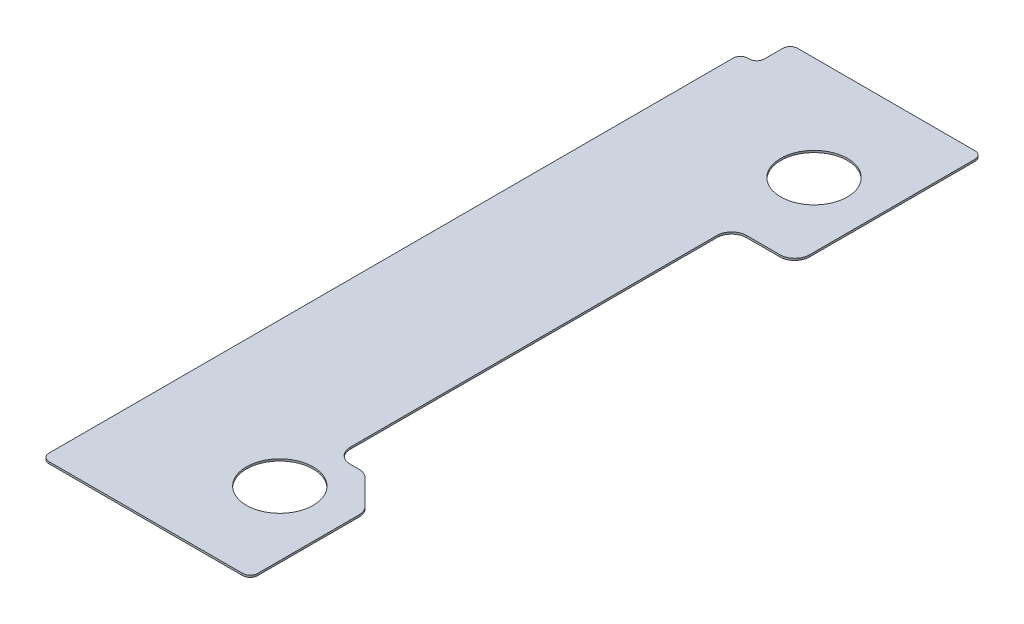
ISO-10303-21;
HEADER;
FILE_DESCRIPTION(('STEP AP214'),'2;1');
FILE_NAME('part.step','',(''),(''),'','','');
FILE_SCHEMA(('AUTOMOTIVE_DESIGN { 1 0 10303 214 1 1 1 1 }'));
ENDSEC;
DATA;
#1=APPLICATION_CONTEXT('core data for automotive mechanical design processes');
#2=APPLICATION_PROTOCOL_DEFINITION('international standard','automotive_design',2000,#1);
#3=PRODUCT_CONTEXT('',#1,'mechanical');
#4=PRODUCT('Part','Part','',(#3));
#5=PRODUCT_RELATED_PRODUCT_CATEGORY('part','',(#4));
#6=PRODUCT_DEFINITION_FORMATION('','',#4);
#7=PRODUCT_DEFINITION_CONTEXT('part definition',#1,'design');
#8=PRODUCT_DEFINITION('design','',#6,#7);
#9=PRODUCT_DEFINITION_SHAPE('','',#8);
#10=(LENGTH_UNIT() NAMED_UNIT(*) SI_UNIT(.MILLI.,.METRE.));
#11=(NAMED_UNIT(*) PLANE_ANGLE_UNIT() SI_UNIT($,.RADIAN.));
#12=(NAMED_UNIT(*) SI_UNIT($,.STERADIAN.) SOLID_ANGLE_UNIT());
#13=UNCERTAINTY_MEASURE_WITH_UNIT(LENGTH_MEASURE(1.E-05),#10,'distance_accuracy_value','');
#14=(GEOMETRIC_REPRESENTATION_CONTEXT(3) GLOBAL_UNCERTAINTY_ASSIGNED_CONTEXT((#13)) GLOBAL_UNIT_ASSIGNED_CONTEXT((#10,
#11,#12)) REPRESENTATION_CONTEXT('',''));
#15=CARTESIAN_POINT('',(0.,0.,0.));
#16=DIRECTION('',(0.,0.,1.));
#17=DIRECTION('',(1.,0.,0.));
#18=AXIS2_PLACEMENT_3D('',#15,#16,#17);
#19=CARTESIAN_POINT('',(8.577632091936,0.2829329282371,1.840361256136));
#20=DIRECTION('',(0.,1.,0.));
#21=DIRECTION('',(-1.75387137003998E-13,0.,-1.));
#22=AXIS2_PLACEMENT_3D('',#19,#20,#21);
#23=PLANE('',#22);
#24=CARTESIAN_POINT('',(3.946632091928,0.282932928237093,-41.49472218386));
#25=DIRECTION('',(0.,-1.,0.));
#26=DIRECTION('',(0.,0.,-1.));
#27=AXIS2_PLACEMENT_3D('',#24,#25,#26);
#28=CIRCLE('',#27,2.25000000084);
#29=CARTESIAN_POINT('',(3.946632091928,0.282932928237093,-43.7447221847));
#30=VERTEX_POINT('',#29);
#31=EDGE_CURVE('E273',#30,#30,#28,.F.);
#32=ORIENTED_EDGE('',*,*,#31,.F.);
#33=EDGE_LOOP('',(#32));
#34=FACE_BOUND('',#33,.T.);
#35=CARTESIAN_POINT('',(3.946632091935,0.282932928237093,-5.494722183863));
#36=DIRECTION('',(0.,-1.,0.));
#37=DIRECTION('',(0.,0.,-1.));
#38=AXIS2_PLACEMENT_3D('',#35,#36,#37);
#39=CIRCLE('',#38,2.250000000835);
#40=CARTESIAN_POINT('',(3.946632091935,0.282932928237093,-7.744722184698));
#41=VERTEX_POINT('',#40);
#42=EDGE_CURVE('E190',#41,#41,#39,.F.);
#43=ORIENTED_EDGE('',*,*,#42,.F.);
#44=EDGE_LOOP('',(#43));
#45=FACE_BOUND('',#44,.T.);
#46=CARTESIAN_POINT('',(5.046632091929,0.282932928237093,-34.84472218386));
#47=DIRECTION('',(0.,-1.,0.));
#48=DIRECTION('',(0.,0.,-1.));
#49=AXIS2_PLACEMENT_3D('',#46,#47,#48);
#50=CIRCLE('',#49,1.);
#51=CARTESIAN_POINT('',(5.04663209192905,0.282932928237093,-35.84472218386));
#52=VERTEX_POINT('',#51);
#53=CARTESIAN_POINT('',(4.0466320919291,0.282932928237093,-34.8447221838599));
#54=VERTEX_POINT('',#53);
#55=EDGE_CURVE('E175',#52,#54,#50,.F.);
#56=ORIENTED_EDGE('',*,*,#55,.F.);
#57=DIRECTION('',(-1.,0.,0.));
#58=VECTOR('',#57,1.);
#59=CARTESIAN_POINT('',(6.171632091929,0.282932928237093,-35.84472218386));
#60=LINE('',#59,#58);
#61=CARTESIAN_POINT('',(7.29663209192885,0.282932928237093,-35.84472218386));
#62=VERTEX_POINT('',#61);
#63=EDGE_CURVE('E173',#62,#52,#60,.T.);
#64=ORIENTED_EDGE('',*,*,#63,.F.);
#65=CARTESIAN_POINT('',(7.296632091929,0.282932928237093,-36.84472218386));
#66=DIRECTION('',(0.,1.,0.));
#67=DIRECTION('',(0.,0.,1.));
#68=AXIS2_PLACEMENT_3D('',#65,#66,#67);
#69=CIRCLE('',#68,0.999999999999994);
#70=CARTESIAN_POINT('',(8.29663209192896,0.282932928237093,-36.8447221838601));
#71=VERTEX_POINT('',#70);
#72=EDGE_CURVE('E19',#62,#71,#69,.T.);
#73=ORIENTED_EDGE('',*,*,#72,.T.);
#74=DIRECTION('',(1.72613245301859E-13,0.,1.));
#75=VECTOR('',#74,1.);
#76=CARTESIAN_POINT('',(8.296632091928,0.282932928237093,-42.41558046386));
#77=LINE('',#76,#75);
#78=CARTESIAN_POINT('',(8.29663209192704,0.282932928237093,-47.98643874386));
#79=VERTEX_POINT('',#78);
#80=EDGE_CURVE('E188',#79,#71,#77,.T.);
#81=ORIENTED_EDGE('',*,*,#80,.F.);
#82=CARTESIAN_POINT('',(7.796632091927,0.282932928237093,-47.98643874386));
#83=DIRECTION('',(0.,1.,0.));
#84=DIRECTION('',(0.,0.,1.));
#85=AXIS2_PLACEMENT_3D('',#82,#83,#84);
#86=CIRCLE('',#85,0.500000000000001);
#87=CARTESIAN_POINT('',(7.79663209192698,0.282932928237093,-48.48643874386));
#88=VERTEX_POINT('',#87);
#89=EDGE_CURVE('E278',#79,#88,#86,.T.);
#90=ORIENTED_EDGE('',*,*,#89,.T.);
#91=DIRECTION('',(1.,0.,0.));
#92=VECTOR('',#91,1.);
#93=CARTESIAN_POINT('',(1.821632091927,0.282932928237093,-48.48643874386));
#94=LINE('',#93,#92);
#95=CARTESIAN_POINT('',(-4.153367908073,0.282932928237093,-48.48643874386));
#96=VERTEX_POINT('',#95);
#97=EDGE_CURVE('E191',#96,#88,#94,.T.);
#98=ORIENTED_EDGE('',*,*,#97,.F.);
#99=CARTESIAN_POINT('',(-4.153367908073,0.282932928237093,-47.98643874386));
#100=DIRECTION('',(0.,1.,0.));
#101=DIRECTION('',(0.,0.,1.));
#102=AXIS2_PLACEMENT_3D('',#99,#100,#101);
#103=CIRCLE('',#102,0.499999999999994);
#104=CARTESIAN_POINT('',(-4.65336790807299,0.282932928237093,-47.98643874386));
#105=VERTEX_POINT('',#104);
#106=EDGE_CURVE('E281',#96,#105,#103,.T.);
#107=ORIENTED_EDGE('',*,*,#106,.T.);
#108=DIRECTION('',(0.,0.,-1.));
#109=VECTOR('',#108,1.);
#110=CARTESIAN_POINT('',(-4.653367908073,0.282932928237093,-47.361438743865));
#111=LINE('',#110,#109);
#112=CARTESIAN_POINT('',(-4.653367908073,0.282932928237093,-46.7364387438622));
#113=VERTEX_POINT('',#112);
#114=EDGE_CURVE('E195',#113,#105,#111,.T.);
#115=ORIENTED_EDGE('',*,*,#114,.F.);
#116=CARTESIAN_POINT('',(-5.153367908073,0.282932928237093,-46.73643874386));
#117=DIRECTION('',(0.,-1.,0.));
#118=DIRECTION('',(0.,0.,-1.));
#119=AXIS2_PLACEMENT_3D('',#116,#117,#118);
#120=CIRCLE('',#119,0.5);
#121=CARTESIAN_POINT('',(-5.15336790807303,0.282932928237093,-46.23643874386));
#122=VERTEX_POINT('',#121);
#123=EDGE_CURVE('E284',#122,#113,#120,.F.);
#124=ORIENTED_EDGE('',*,*,#123,.F.);
#125=DIRECTION('',(1.,0.,0.));
#126=VECTOR('',#125,1.);
#127=CARTESIAN_POINT('',(-5.203367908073,0.282932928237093,-46.23643874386));
#128=LINE('',#127,#126);
#129=CARTESIAN_POINT('',(-5.25336790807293,0.282932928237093,-46.23643874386));
#130=VERTEX_POINT('',#129);
#131=EDGE_CURVE('E199',#130,#122,#128,.T.);
#132=ORIENTED_EDGE('',*,*,#131,.F.);
#133=CARTESIAN_POINT('',(-5.253367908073,0.282932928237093,-45.73643874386));
#134=DIRECTION('',(0.,1.,0.));
#135=DIRECTION('',(0.,0.,1.));
#136=AXIS2_PLACEMENT_3D('',#133,#134,#135);
#137=CIRCLE('',#136,0.499999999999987);
#138=CARTESIAN_POINT('',(-5.75336790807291,0.282932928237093,-45.7364387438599));
#139=VERTEX_POINT('',#138);
#140=EDGE_CURVE('E286',#130,#139,#137,.T.);
#141=ORIENTED_EDGE('',*,*,#140,.T.);
#142=DIRECTION('',(-1.87754422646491E-13,0.,-1.));
#143=VECTOR('',#142,1.);
#144=CARTESIAN_POINT('',(-5.7533679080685,0.282932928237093,-22.6914387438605));
#145=LINE('',#144,#143);
#146=CARTESIAN_POINT('',(-5.75336790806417,0.282932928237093,0.353561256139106));
#147=VERTEX_POINT('',#146);
#148=EDGE_CURVE('E203',#147,#139,#145,.T.);
#149=ORIENTED_EDGE('',*,*,#148,.F.);
#150=CARTESIAN_POINT('',(-5.253367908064,0.282932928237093,0.3535612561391));
#151=DIRECTION('',(0.,1.,0.));
#152=DIRECTION('',(0.,0.,1.));
#153=AXIS2_PLACEMENT_3D('',#150,#151,#152);
#154=CIRCLE('',#153,0.5);
#155=CARTESIAN_POINT('',(-5.25336790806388,0.282932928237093,0.853561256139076));
#156=VERTEX_POINT('',#155);
#157=EDGE_CURVE('E289',#147,#156,#154,.T.);
#158=ORIENTED_EDGE('',*,*,#157,.T.);
#159=DIRECTION('',(-1.,0.,1.8419134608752E-13));
#160=VECTOR('',#159,1.);
#161=CARTESIAN_POINT('',(1.271632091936,0.282932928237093,0.85356125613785));
#162=LINE('',#161,#160);
#163=CARTESIAN_POINT('',(7.79663209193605,0.282932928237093,0.853561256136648));
#164=VERTEX_POINT('',#163);
#165=EDGE_CURVE('E207',#164,#156,#162,.T.);
#166=ORIENTED_EDGE('',*,*,#165,.F.);
#167=CARTESIAN_POINT('',(7.796632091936,0.282932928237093,0.3535612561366));
#168=DIRECTION('',(0.,1.,0.));
#169=DIRECTION('',(0.,0.,1.));
#170=AXIS2_PLACEMENT_3D('',#167,#168,#169);
#171=CIRCLE('',#170,0.5);
#172=CARTESIAN_POINT('',(8.29663209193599,0.282932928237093,0.353561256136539));
#173=VERTEX_POINT('',#172);
#174=EDGE_CURVE('E292',#164,#173,#171,.T.);
#175=ORIENTED_EDGE('',*,*,#174,.T.);
#176=DIRECTION('',(1.40585323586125E-13,0.,1.));
#177=VECTOR('',#176,1.);
#178=CARTESIAN_POINT('',(8.2966320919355,0.282932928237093,-3.06347368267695));
#179=LINE('',#178,#177);
#180=CARTESIAN_POINT('',(8.29663209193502,0.282932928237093,-6.48050862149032));
#181=VERTEX_POINT('',#180);
#182=EDGE_CURVE('E211',#181,#173,#179,.T.);
#183=ORIENTED_EDGE('',*,*,#182,.F.);
#184=CARTESIAN_POINT('',(7.296632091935,0.282932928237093,-6.48050862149));
#185=DIRECTION('',(0.,1.,0.));
#186=DIRECTION('',(0.,0.,1.));
#187=AXIS2_PLACEMENT_3D('',#184,#185,#186);
#188=CIRCLE('',#187,1.);
#189=CARTESIAN_POINT('',(8.00373887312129,0.282932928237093,-7.18761540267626));
#190=VERTEX_POINT('',#189);
#191=EDGE_CURVE('E295',#181,#190,#188,.T.);
#192=ORIENTED_EDGE('',*,*,#191,.T.);
#193=DIRECTION('',(0.707106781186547,0.,0.707106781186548));
#194=VECTOR('',#193,1.);
#195=CARTESIAN_POINT('',(7.171632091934,0.282932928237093,-8.019722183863));
#196=LINE('',#195,#194);
#197=CARTESIAN_POINT('',(6.33952531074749,0.282932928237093,-8.85182896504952));
#198=VERTEX_POINT('',#197);
#199=EDGE_CURVE('E215',#198,#190,#196,.T.);
#200=ORIENTED_EDGE('',*,*,#199,.F.);
#201=CARTESIAN_POINT('',(5.632418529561,0.282932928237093,-8.144722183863));
#202=DIRECTION('',(0.,1.,0.));
#203=DIRECTION('',(0.,0.,1.));
#204=AXIS2_PLACEMENT_3D('',#201,#202,#203);
#205=CIRCLE('',#204,1.00000000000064);
#206=CARTESIAN_POINT('',(5.63241852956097,0.282932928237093,-9.14472218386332));
#207=VERTEX_POINT('',#206);
#208=EDGE_CURVE('E298',#198,#207,#205,.T.);
#209=ORIENTED_EDGE('',*,*,#208,.T.);
#210=DIRECTION('',(1.,0.,0.));
#211=VECTOR('',#210,1.);
#212=CARTESIAN_POINT('',(5.3395253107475,0.282932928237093,-9.144722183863));
#213=LINE('',#212,#211);
#214=CARTESIAN_POINT('',(5.04663209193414,0.282932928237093,-9.144722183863));
#215=VERTEX_POINT('',#214);
#216=EDGE_CURVE('E219',#215,#207,#213,.T.);
#217=ORIENTED_EDGE('',*,*,#216,.F.);
#218=CARTESIAN_POINT('',(5.046632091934,0.282932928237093,-10.14472218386));
#219=DIRECTION('',(0.,-1.,0.));
#220=DIRECTION('',(0.,0.,-1.));
#221=AXIS2_PLACEMENT_3D('',#218,#219,#220);
#222=CIRCLE('',#221,0.999999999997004);
#223=CARTESIAN_POINT('',(4.04663209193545,0.282932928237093,-10.14472218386));
#224=VERTEX_POINT('',#223);
#225=EDGE_CURVE('E301',#224,#215,#222,.F.);
#226=ORIENTED_EDGE('',*,*,#225,.F.);
#227=DIRECTION('',(1.94656665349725E-13,0.,1.));
#228=VECTOR('',#227,1.);
#229=CARTESIAN_POINT('',(4.0466320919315,0.282932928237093,-22.4947221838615));
#230=LINE('',#229,#228);
#231=EDGE_CURVE('E223',#54,#224,#230,.T.);
#232=ORIENTED_EDGE('',*,*,#231,.F.);
#233=EDGE_LOOP('',(#56,#64,#73,#81,#90,#98,#107,#115,#124,#132,#141,#149,#158,#166,#175,#183,
#192,#200,#209,#217,#226,#232));
#234=FACE_BOUND('',#233,.T.);
#235=ADVANCED_FACE('F15',(#34,#45,#234),#23,.T.);
#236=CARTESIAN_POINT('',(7.296632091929,0.152932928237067,-36.84472218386));
#237=DIRECTION('',(0.,1.,0.));
#238=DIRECTION('',(0.,0.,1.));
#239=AXIS2_PLACEMENT_3D('',#236,#237,#238);
#240=CYLINDRICAL_SURFACE('',#239,0.999999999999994);
#241=DIRECTION('',(0.,1.,0.));
#242=VECTOR('',#241,1.);
#243=CARTESIAN_POINT('',(7.29663209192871,0.21793292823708,-35.84472218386));
#244=LINE('',#243,#242);
#245=CARTESIAN_POINT('',(7.29663209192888,0.152932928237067,-35.8447221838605));
#246=VERTEX_POINT('',#245);
#247=EDGE_CURVE('E165',#246,#62,#244,.T.);
#248=ORIENTED_EDGE('',*,*,#247,.F.);
#249=CARTESIAN_POINT('',(7.296632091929,0.152932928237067,-36.84472218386));
#250=DIRECTION('',(0.,1.,0.));
#251=DIRECTION('',(0.,0.,1.));
#252=AXIS2_PLACEMENT_3D('',#249,#250,#251);
#253=CIRCLE('',#252,0.999999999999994);
#254=CARTESIAN_POINT('',(8.29663209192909,0.152932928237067,-36.8447221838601));
#255=VERTEX_POINT('',#254);
#256=EDGE_CURVE('E271',#255,#246,#253,.F.);
#257=ORIENTED_EDGE('',*,*,#256,.F.);
#258=DIRECTION('',(0.,-1.,0.));
#259=VECTOR('',#258,1.);
#260=CARTESIAN_POINT('',(8.29663209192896,0.21793292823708,-36.84472218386));
#261=LINE('',#260,#259);
#262=EDGE_CURVE('E168',#71,#255,#261,.T.);
#263=ORIENTED_EDGE('',*,*,#262,.F.);
#264=ORIENTED_EDGE('',*,*,#72,.F.);
#265=EDGE_LOOP('',(#248,#257,#263,#264));
#266=FACE_BOUND('',#265,.T.);
#267=ADVANCED_FACE('F163',(#266),#240,.T.);
#268=CARTESIAN_POINT('',(7.358194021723,0.3444948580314,-35.84472218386));
#269=DIRECTION('',(0.,0.,1.));
#270=DIRECTION('',(-1.,0.,0.));
#271=AXIS2_PLACEMENT_3D('',#268,#269,#270);
#272=PLANE('',#271);
#273=DIRECTION('',(0.,1.,0.));
#274=VECTOR('',#273,1.);
#275=CARTESIAN_POINT('',(5.04663209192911,0.21793292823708,-35.84472218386));
#276=LINE('',#275,#274);
#277=CARTESIAN_POINT('',(5.04663209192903,0.152932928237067,-35.8447221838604));
#278=VERTEX_POINT('',#277);
#279=EDGE_CURVE('E178',#278,#52,#276,.T.);
#280=ORIENTED_EDGE('',*,*,#279,.F.);
#281=DIRECTION('',(-1.,0.,0.));
#282=VECTOR('',#281,1.);
#283=CARTESIAN_POINT('',(1.27163209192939,0.1529329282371,-35.8447221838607));
#284=LINE('',#283,#282);
#285=EDGE_CURVE('E182',#246,#278,#284,.T.);
#286=ORIENTED_EDGE('',*,*,#285,.F.);
#287=ORIENTED_EDGE('',*,*,#247,.T.);
#288=ORIENTED_EDGE('',*,*,#63,.T.);
#289=EDGE_LOOP('',(#280,#286,#287,#288));
#290=FACE_BOUND('',#289,.T.);
#291=ADVANCED_FACE('F180',(#290),#272,.T.);
#292=CARTESIAN_POINT('',(5.046632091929,0.282932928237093,-34.84472218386));
#293=DIRECTION('',(0.,-1.,0.));
#294=DIRECTION('',(0.,0.,-1.));
#295=AXIS2_PLACEMENT_3D('',#292,#293,#294);
#296=CYLINDRICAL_SURFACE('',#295,1.);
#297=ORIENTED_EDGE('',*,*,#279,.T.);
#298=ORIENTED_EDGE('',*,*,#55,.T.);
#299=DIRECTION('',(0.,1.,0.));
#300=VECTOR('',#299,1.);
#301=CARTESIAN_POINT('',(4.0466320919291,0.21793292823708,-34.8447221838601));
#302=LINE('',#301,#300);
#303=CARTESIAN_POINT('',(4.04663209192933,0.152932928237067,-34.8447221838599));
#304=VERTEX_POINT('',#303);
#305=EDGE_CURVE('E225',#304,#54,#302,.T.);
#306=ORIENTED_EDGE('',*,*,#305,.F.);
#307=CARTESIAN_POINT('',(5.046632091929,0.152932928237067,-34.84472218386));
#308=DIRECTION('',(0.,-1.,0.));
#309=DIRECTION('',(0.,0.,-1.));
#310=AXIS2_PLACEMENT_3D('',#307,#308,#309);
#311=CIRCLE('',#310,1.);
#312=EDGE_CURVE('E268',#278,#304,#311,.F.);
#313=ORIENTED_EDGE('',*,*,#312,.F.);
#314=EDGE_LOOP('',(#297,#298,#306,#313));
#315=FACE_BOUND('',#314,.T.);
#316=ADVANCED_FACE('F305',(#315),#296,.F.);
#317=CARTESIAN_POINT('',(4.046632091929,0.3444948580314,-35.33872218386));
#318=DIRECTION('',(1.,0.,-1.94656665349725E-13));
#319=DIRECTION('',(1.94656665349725E-13,0.,1.));
#320=AXIS2_PLACEMENT_3D('',#317,#318,#319);
#321=PLANE('',#320);
#322=DIRECTION('',(0.,1.,0.));
#323=VECTOR('',#322,1.);
#324=CARTESIAN_POINT('',(4.046632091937,0.21793292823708,-10.1447221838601));
#325=LINE('',#324,#323);
#326=CARTESIAN_POINT('',(4.04663209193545,0.152932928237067,-10.14472218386));
#327=VERTEX_POINT('',#326);
#328=EDGE_CURVE('E224',#327,#224,#325,.T.);
#329=ORIENTED_EDGE('',*,*,#328,.F.);
#330=DIRECTION('',(1.75387137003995E-13,0.,1.));
#331=VECTOR('',#330,1.);
#332=CARTESIAN_POINT('',(4.0466320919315,0.1529329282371,-23.8164387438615));
#333=LINE('',#332,#331);
#334=EDGE_CURVE('E267',#304,#327,#333,.T.);
#335=ORIENTED_EDGE('',*,*,#334,.F.);
#336=ORIENTED_EDGE('',*,*,#305,.T.);
#337=ORIENTED_EDGE('',*,*,#231,.T.);
#338=EDGE_LOOP('',(#329,#335,#336,#337));
#339=FACE_BOUND('',#338,.T.);
#340=ADVANCED_FACE('F348',(#339),#321,.T.);
#341=CARTESIAN_POINT('',(5.046632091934,0.282932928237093,-10.14472218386));
#342=DIRECTION('',(0.,-1.,0.));
#343=DIRECTION('',(0.,0.,-1.));
#344=AXIS2_PLACEMENT_3D('',#341,#342,#343);
#345=CYLINDRICAL_SURFACE('',#344,0.999999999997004);
#346=ORIENTED_EDGE('',*,*,#328,.T.);
#347=ORIENTED_EDGE('',*,*,#225,.T.);
#348=DIRECTION('',(0.,1.,0.));
#349=VECTOR('',#348,1.);
#350=CARTESIAN_POINT('',(5.04663209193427,0.21793292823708,-9.144722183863));
#351=LINE('',#350,#349);
#352=CARTESIAN_POINT('',(5.04663209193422,0.152932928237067,-9.14472218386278));
#353=VERTEX_POINT('',#352);
#354=EDGE_CURVE('E222',#353,#215,#351,.T.);
#355=ORIENTED_EDGE('',*,*,#354,.F.);
#356=CARTESIAN_POINT('',(5.046632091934,0.152932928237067,-10.14472218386));
#357=DIRECTION('',(0.,-1.,0.));
#358=DIRECTION('',(0.,0.,-1.));
#359=AXIS2_PLACEMENT_3D('',#356,#357,#358);
#360=CIRCLE('',#359,0.999999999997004);
#361=EDGE_CURVE('E264',#327,#353,#360,.F.);
#362=ORIENTED_EDGE('',*,*,#361,.F.);
#363=EDGE_LOOP('',(#346,#347,#355,#362));
#364=FACE_BOUND('',#363,.T.);
#365=ADVANCED_FACE('F344',(#364),#345,.F.);
#366=CARTESIAN_POINT('',(4.98507016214,0.3444948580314,-9.144722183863));
#367=DIRECTION('',(0.,0.,-1.));
#368=DIRECTION('',(1.,0.,0.));
#369=AXIS2_PLACEMENT_3D('',#366,#367,#368);
#370=PLANE('',#369);
#371=ORIENTED_EDGE('',*,*,#354,.T.);
#372=ORIENTED_EDGE('',*,*,#216,.T.);
#373=DIRECTION('',(0.,-1.,0.));
#374=VECTOR('',#373,1.);
#375=CARTESIAN_POINT('',(5.63241852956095,0.21793292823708,-9.14472218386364));
#376=LINE('',#375,#374);
#377=CARTESIAN_POINT('',(5.63241852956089,0.152932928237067,-9.14472218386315));
#378=VERTEX_POINT('',#377);
#379=EDGE_CURVE('E221',#207,#378,#376,.T.);
#380=ORIENTED_EDGE('',*,*,#379,.T.);
#381=DIRECTION('',(1.,0.,-1.61339255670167E-13));
#382=VECTOR('',#381,1.);
#383=CARTESIAN_POINT('',(1.27163209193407,0.1529329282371,-9.14472218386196));
#384=LINE('',#383,#382);
#385=EDGE_CURVE('E263',#353,#378,#384,.T.);
#386=ORIENTED_EDGE('',*,*,#385,.F.);
#387=EDGE_LOOP('',(#371,#372,#380,#386));
#388=FACE_BOUND('',#387,.T.);
#389=ADVANCED_FACE('F353',(#388),#370,.T.);
#390=CARTESIAN_POINT('',(5.632418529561,0.152932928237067,-8.144722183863));
#391=DIRECTION('',(0.,1.,0.));
#392=DIRECTION('',(0.,0.,1.));
#393=AXIS2_PLACEMENT_3D('',#390,#391,#392);
#394=CYLINDRICAL_SURFACE('',#393,1.00000000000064);
#395=DIRECTION('',(0.,1.,0.));
#396=VECTOR('',#395,1.);
#397=CARTESIAN_POINT('',(6.33952531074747,0.21793292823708,-8.85182896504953));
#398=LINE('',#397,#396);
#399=CARTESIAN_POINT('',(6.3395253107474,0.152932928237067,-8.85182896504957));
#400=VERTEX_POINT('',#399);
#401=EDGE_CURVE('E218',#400,#198,#398,.T.);
#402=ORIENTED_EDGE('',*,*,#401,.F.);
#403=CARTESIAN_POINT('',(5.632418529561,0.152932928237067,-8.144722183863));
#404=DIRECTION('',(0.,1.,0.));
#405=DIRECTION('',(0.,0.,1.));
#406=AXIS2_PLACEMENT_3D('',#403,#404,#405);
#407=CIRCLE('',#406,1.00000000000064);
#408=EDGE_CURVE('E260',#378,#400,#407,.F.);
#409=ORIENTED_EDGE('',*,*,#408,.F.);
#410=ORIENTED_EDGE('',*,*,#379,.F.);
#411=ORIENTED_EDGE('',*,*,#208,.F.);
#412=EDGE_LOOP('',(#402,#409,#410,#411));
#413=FACE_BOUND('',#412,.T.);
#414=ADVANCED_FACE('F425',(#413),#394,.T.);
#415=CARTESIAN_POINT('',(6.295994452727,0.3444948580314,-8.89535982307));
#416=DIRECTION('',(0.707106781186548,0.,-0.707106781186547));
#417=DIRECTION('',(0.707106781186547,0.,0.707106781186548));
#418=AXIS2_PLACEMENT_3D('',#415,#416,#417);
#419=PLANE('',#418);
#420=ORIENTED_EDGE('',*,*,#401,.T.);
#421=ORIENTED_EDGE('',*,*,#199,.T.);
#422=DIRECTION('',(0.,-1.,0.));
#423=VECTOR('',#422,1.);
#424=CARTESIAN_POINT('',(8.00373887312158,0.21793292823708,-7.18761540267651));
#425=LINE('',#424,#423);
#426=CARTESIAN_POINT('',(8.00373887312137,0.152932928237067,-7.18761540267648));
#427=VERTEX_POINT('',#426);
#428=EDGE_CURVE('E217',#190,#427,#425,.T.);
#429=ORIENTED_EDGE('',*,*,#428,.T.);
#430=DIRECTION('',(0.707106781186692,0.,0.707106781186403));
#431=VECTOR('',#430,1.);
#432=CARTESIAN_POINT('',(6.33952531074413,0.1529329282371,-8.8518289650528));
#433=LINE('',#432,#431);
#434=EDGE_CURVE('E257',#400,#427,#433,.T.);
#435=ORIENTED_EDGE('',*,*,#434,.F.);
#436=EDGE_LOOP('',(#420,#421,#429,#435));
#437=FACE_BOUND('',#436,.T.);
#438=ADVANCED_FACE('F423',(#437),#419,.T.);
#439=CARTESIAN_POINT('',(7.296632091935,0.152932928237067,-6.48050862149));
#440=DIRECTION('',(0.,1.,0.));
#441=DIRECTION('',(0.,0.,1.));
#442=AXIS2_PLACEMENT_3D('',#439,#440,#441);
#443=CYLINDRICAL_SURFACE('',#442,1.);
#444=DIRECTION('',(0.,1.,0.));
#445=VECTOR('',#444,1.);
#446=CARTESIAN_POINT('',(8.29663209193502,0.21793292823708,-6.4805086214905));
#447=LINE('',#446,#445);
#448=CARTESIAN_POINT('',(8.29663209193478,0.152932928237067,-6.48050862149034));
#449=VERTEX_POINT('',#448);
#450=EDGE_CURVE('E214',#449,#181,#447,.T.);
#451=ORIENTED_EDGE('',*,*,#450,.F.);
#452=CARTESIAN_POINT('',(7.296632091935,0.152932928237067,-6.48050862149));
#453=DIRECTION('',(0.,1.,0.));
#454=DIRECTION('',(0.,0.,1.));
#455=AXIS2_PLACEMENT_3D('',#452,#453,#454);
#456=CIRCLE('',#455,1.);
#457=EDGE_CURVE('E254',#427,#449,#456,.F.);
#458=ORIENTED_EDGE('',*,*,#457,.F.);
#459=ORIENTED_EDGE('',*,*,#428,.F.);
#460=ORIENTED_EDGE('',*,*,#191,.F.);
#461=EDGE_LOOP('',(#451,#458,#459,#460));
#462=FACE_BOUND('',#461,.T.);
#463=ADVANCED_FACE('F420',(#462),#443,.T.);
#464=CARTESIAN_POINT('',(8.296632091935,0.3444948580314,-6.617190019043));
#465=DIRECTION('',(1.,0.,-1.40585323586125E-13));
#466=DIRECTION('',(1.40585323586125E-13,0.,1.));
#467=AXIS2_PLACEMENT_3D('',#464,#465,#466);
#468=PLANE('',#467);
#469=DIRECTION('',(0.,-1.,0.));
#470=VECTOR('',#469,1.);
#471=CARTESIAN_POINT('',(8.296632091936,0.21793292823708,0.353561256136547));
#472=LINE('',#471,#470);
#473=CARTESIAN_POINT('',(8.29663209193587,0.152932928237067,0.35356125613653));
#474=VERTEX_POINT('',#473);
#475=EDGE_CURVE('E213',#173,#474,#472,.T.);
#476=ORIENTED_EDGE('',*,*,#475,.T.);
#477=DIRECTION('',(1.75387137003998E-13,0.,1.));
#478=VECTOR('',#477,1.);
#479=CARTESIAN_POINT('',(8.2966320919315,0.1529329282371,-23.816438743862));
#480=LINE('',#479,#478);
#481=EDGE_CURVE('E253',#449,#474,#480,.T.);
#482=ORIENTED_EDGE('',*,*,#481,.F.);
#483=ORIENTED_EDGE('',*,*,#450,.T.);
#484=ORIENTED_EDGE('',*,*,#182,.T.);
#485=EDGE_LOOP('',(#476,#482,#483,#484));
#486=FACE_BOUND('',#485,.T.);
#487=ADVANCED_FACE('F416',(#486),#468,.T.);
#488=CARTESIAN_POINT('',(7.796632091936,0.152932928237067,0.3535612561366));
#489=DIRECTION('',(0.,1.,0.));
#490=DIRECTION('',(0.,0.,1.));
#491=AXIS2_PLACEMENT_3D('',#488,#489,#490);
#492=CYLINDRICAL_SURFACE('',#491,0.5);
#493=DIRECTION('',(0.,1.,0.));
#494=VECTOR('',#493,1.);
#495=CARTESIAN_POINT('',(7.796632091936,0.21793292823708,0.853561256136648));
#496=LINE('',#495,#494);
#497=CARTESIAN_POINT('',(7.79663209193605,0.152932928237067,0.853561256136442));
#498=VERTEX_POINT('',#497);
#499=EDGE_CURVE('E210',#498,#164,#496,.T.);
#500=ORIENTED_EDGE('',*,*,#499,.F.);
#501=CARTESIAN_POINT('',(7.796632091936,0.152932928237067,0.3535612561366));
#502=DIRECTION('',(0.,1.,0.));
#503=DIRECTION('',(0.,0.,1.));
#504=AXIS2_PLACEMENT_3D('',#501,#502,#503);
#505=CIRCLE('',#504,0.5);
#506=EDGE_CURVE('E250',#474,#498,#505,.F.);
#507=ORIENTED_EDGE('',*,*,#506,.F.);
#508=ORIENTED_EDGE('',*,*,#475,.F.);
#509=ORIENTED_EDGE('',*,*,#174,.F.);
#510=EDGE_LOOP('',(#500,#507,#508,#509));
#511=FACE_BOUND('',#510,.T.);
#512=ADVANCED_FACE('F413',(#511),#492,.T.);
#513=CARTESIAN_POINT('',(8.057632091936,0.3444948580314,0.8535612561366));
#514=DIRECTION('',(1.8419134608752E-13,0.,1.));
#515=DIRECTION('',(-1.,0.,1.8419134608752E-13));
#516=AXIS2_PLACEMENT_3D('',#513,#514,#515);
#517=PLANE('',#516);
#518=ORIENTED_EDGE('',*,*,#499,.T.);
#519=ORIENTED_EDGE('',*,*,#165,.T.);
#520=DIRECTION('',(0.,-1.,0.));
#521=VECTOR('',#520,1.);
#522=CARTESIAN_POINT('',(-5.25336790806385,0.21793292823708,0.8535612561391));
#523=LINE('',#522,#521);
#524=CARTESIAN_POINT('',(-5.25336790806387,0.152932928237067,0.853561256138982));
#525=VERTEX_POINT('',#524);
#526=EDGE_CURVE('E209',#156,#525,#523,.T.);
#527=ORIENTED_EDGE('',*,*,#526,.T.);
#528=DIRECTION('',(-1.,0.,2.01347592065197E-13));
#529=VECTOR('',#528,1.);
#530=CARTESIAN_POINT('',(1.27163209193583,0.1529329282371,0.853561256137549));
#531=LINE('',#530,#529);
#532=EDGE_CURVE('E249',#498,#525,#531,.T.);
#533=ORIENTED_EDGE('',*,*,#532,.F.);
#534=EDGE_LOOP('',(#518,#519,#527,#533));
#535=FACE_BOUND('',#534,.T.);
#536=ADVANCED_FACE('F410',(#535),#517,.T.);
#537=CARTESIAN_POINT('',(-5.253367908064,0.152932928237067,0.3535612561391));
#538=DIRECTION('',(0.,1.,0.));
#539=DIRECTION('',(0.,0.,1.));
#540=AXIS2_PLACEMENT_3D('',#537,#538,#539);
#541=CYLINDRICAL_SURFACE('',#540,0.5);
#542=DIRECTION('',(0.,1.,0.));
#543=VECTOR('',#542,1.);
#544=CARTESIAN_POINT('',(-5.75336790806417,0.21793292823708,0.353561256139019));
#545=LINE('',#544,#543);
#546=CARTESIAN_POINT('',(-5.75336790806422,0.152932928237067,0.353561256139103));
#547=VERTEX_POINT('',#546);
#548=EDGE_CURVE('E206',#547,#147,#545,.T.);
#549=ORIENTED_EDGE('',*,*,#548,.F.);
#550=CARTESIAN_POINT('',(-5.253367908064,0.152932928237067,0.3535612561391));
#551=DIRECTION('',(0.,1.,0.));
#552=DIRECTION('',(0.,0.,1.));
#553=AXIS2_PLACEMENT_3D('',#550,#551,#552);
#554=CIRCLE('',#553,0.5);
#555=EDGE_CURVE('E246',#525,#547,#554,.F.);
#556=ORIENTED_EDGE('',*,*,#555,.F.);
#557=ORIENTED_EDGE('',*,*,#526,.F.);
#558=ORIENTED_EDGE('',*,*,#157,.F.);
#559=EDGE_LOOP('',(#549,#556,#557,#558));
#560=FACE_BOUND('',#559,.T.);
#561=ADVANCED_FACE('F403',(#560),#541,.T.);
#562=CARTESIAN_POINT('',(-5.753367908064,0.3444948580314,1.275361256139));
#563=DIRECTION('',(-1.,0.,1.87754422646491E-13));
#564=DIRECTION('',(-1.87754422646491E-13,0.,-1.));
#565=AXIS2_PLACEMENT_3D('',#562,#563,#564);
#566=PLANE('',#565);
#567=ORIENTED_EDGE('',*,*,#548,.T.);
#568=ORIENTED_EDGE('',*,*,#148,.T.);
#569=DIRECTION('',(0.,-1.,0.));
#570=VECTOR('',#569,1.);
#571=CARTESIAN_POINT('',(-5.75336790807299,0.21793292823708,-45.73643874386));
#572=LINE('',#571,#570);
#573=CARTESIAN_POINT('',(-5.75336790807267,0.152932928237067,-45.7364387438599));
#574=VERTEX_POINT('',#573);
#575=EDGE_CURVE('E205',#139,#574,#572,.T.);
#576=ORIENTED_EDGE('',*,*,#575,.T.);
#577=DIRECTION('',(-1.75404040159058E-13,0.,-1.));
#578=VECTOR('',#577,1.);
#579=CARTESIAN_POINT('',(-5.7533679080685,0.1529329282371,-23.8164387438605));
#580=LINE('',#579,#578);
#581=EDGE_CURVE('E245',#547,#574,#580,.T.);
#582=ORIENTED_EDGE('',*,*,#581,.F.);
#583=EDGE_LOOP('',(#567,#568,#576,#582));
#584=FACE_BOUND('',#583,.T.);
#585=ADVANCED_FACE('F400',(#584),#566,.T.);
#586=CARTESIAN_POINT('',(-5.253367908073,0.152932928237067,-45.73643874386));
#587=DIRECTION('',(0.,1.,0.));
#588=DIRECTION('',(0.,0.,1.));
#589=AXIS2_PLACEMENT_3D('',#586,#587,#588);
#590=CYLINDRICAL_SURFACE('',#589,0.499999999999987);
#591=DIRECTION('',(0.,1.,0.));
#592=VECTOR('',#591,1.);
#593=CARTESIAN_POINT('',(-5.25336790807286,0.21793292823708,-46.23643874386));
#594=LINE('',#593,#592);
#595=CARTESIAN_POINT('',(-5.25336790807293,0.152932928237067,-46.23643874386));
#596=VERTEX_POINT('',#595);
#597=EDGE_CURVE('E202',#596,#130,#594,.T.);
#598=ORIENTED_EDGE('',*,*,#597,.F.);
#599=CARTESIAN_POINT('',(-5.253367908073,0.152932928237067,-45.73643874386));
#600=DIRECTION('',(0.,1.,0.));
#601=DIRECTION('',(0.,0.,1.));
#602=AXIS2_PLACEMENT_3D('',#599,#600,#601);
#603=CIRCLE('',#602,0.499999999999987);
#604=EDGE_CURVE('E242',#574,#596,#603,.F.);
#605=ORIENTED_EDGE('',*,*,#604,.F.);
#606=ORIENTED_EDGE('',*,*,#575,.F.);
#607=ORIENTED_EDGE('',*,*,#140,.F.);
#608=EDGE_LOOP('',(#598,#605,#606,#607));
#609=FACE_BOUND('',#608,.T.);
#610=ADVANCED_FACE('F397',(#609),#590,.T.);
#611=CARTESIAN_POINT('',(-5.314929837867,0.3444948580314,-46.23643874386));
#612=DIRECTION('',(0.,0.,-1.));
#613=DIRECTION('',(1.,0.,0.));
#614=AXIS2_PLACEMENT_3D('',#611,#612,#613);
#615=PLANE('',#614);
#616=DIRECTION('',(0.,1.,0.));
#617=VECTOR('',#616,1.);
#618=CARTESIAN_POINT('',(-5.15336790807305,0.21793292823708,-46.23643874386));
#619=LINE('',#618,#617);
#620=CARTESIAN_POINT('',(-5.15336790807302,0.152932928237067,-46.23643874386));
#621=VERTEX_POINT('',#620);
#622=EDGE_CURVE('E201',#621,#122,#619,.T.);
#623=ORIENTED_EDGE('',*,*,#622,.F.);
#624=DIRECTION('',(1.,0.,0.));
#625=VECTOR('',#624,1.);
#626=CARTESIAN_POINT('',(1.27163209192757,0.1529329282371,-46.2364387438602));
#627=LINE('',#626,#625);
#628=EDGE_CURVE('E241',#596,#621,#627,.T.);
#629=ORIENTED_EDGE('',*,*,#628,.F.);
#630=ORIENTED_EDGE('',*,*,#597,.T.);
#631=ORIENTED_EDGE('',*,*,#131,.T.);
#632=EDGE_LOOP('',(#623,#629,#630,#631));
#633=FACE_BOUND('',#632,.T.);
#634=ADVANCED_FACE('F392',(#633),#615,.T.);
#635=CARTESIAN_POINT('',(-5.153367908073,0.282932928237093,-46.73643874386));
#636=DIRECTION('',(0.,-1.,0.));
#637=DIRECTION('',(0.,0.,-1.));
#638=AXIS2_PLACEMENT_3D('',#635,#636,#637);
#639=CYLINDRICAL_SURFACE('',#638,0.5);
#640=ORIENTED_EDGE('',*,*,#622,.T.);
#641=ORIENTED_EDGE('',*,*,#123,.T.);
#642=DIRECTION('',(0.,1.,0.));
#643=VECTOR('',#642,1.);
#644=CARTESIAN_POINT('',(-4.653367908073,0.21793292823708,-46.7364387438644));
#645=LINE('',#644,#643);
#646=CARTESIAN_POINT('',(-4.65336790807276,0.152932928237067,-46.7364387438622));
#647=VERTEX_POINT('',#646);
#648=EDGE_CURVE('E198',#647,#113,#645,.T.);
#649=ORIENTED_EDGE('',*,*,#648,.F.);
#650=CARTESIAN_POINT('',(-5.153367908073,0.152932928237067,-46.73643874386));
#651=DIRECTION('',(0.,-1.,0.));
#652=DIRECTION('',(0.,0.,-1.));
#653=AXIS2_PLACEMENT_3D('',#650,#651,#652);
#654=CIRCLE('',#653,0.5);
#655=EDGE_CURVE('E238',#621,#647,#654,.F.);
#656=ORIENTED_EDGE('',*,*,#655,.F.);
#657=EDGE_LOOP('',(#640,#641,#649,#656));
#658=FACE_BOUND('',#657,.T.);
#659=ADVANCED_FACE('F389',(#658),#639,.F.);
#660=CARTESIAN_POINT('',(-4.653367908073,0.3444948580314,-46.67487681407));
#661=DIRECTION('',(-1.,0.,0.));
#662=DIRECTION('',(0.,0.,-1.));
#663=AXIS2_PLACEMENT_3D('',#660,#661,#662);
#664=PLANE('',#663);
#665=ORIENTED_EDGE('',*,*,#648,.T.);
#666=ORIENTED_EDGE('',*,*,#114,.T.);
#667=DIRECTION('',(0.,-1.,0.));
#668=VECTOR('',#667,1.);
#669=CARTESIAN_POINT('',(-4.65336790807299,0.21793292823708,-47.98643874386));
#670=LINE('',#669,#668);
#671=CARTESIAN_POINT('',(-4.65336790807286,0.152932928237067,-47.9864387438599));
#672=VERTEX_POINT('',#671);
#673=EDGE_CURVE('E197',#105,#672,#670,.T.);
#674=ORIENTED_EDGE('',*,*,#673,.T.);
#675=DIRECTION('',(-1.75387137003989E-13,0.,-1.));
#676=VECTOR('',#675,1.);
#677=CARTESIAN_POINT('',(-4.6533679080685,0.1529329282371,-23.8164387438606));
#678=LINE('',#677,#676);
#679=EDGE_CURVE('E237',#647,#672,#678,.T.);
#680=ORIENTED_EDGE('',*,*,#679,.F.);
#681=EDGE_LOOP('',(#665,#666,#674,#680));
#682=FACE_BOUND('',#681,.T.);
#683=ADVANCED_FACE('F386',(#682),#664,.T.);
#684=CARTESIAN_POINT('',(-4.153367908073,0.152932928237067,-47.98643874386));
#685=DIRECTION('',(0.,1.,0.));
#686=DIRECTION('',(0.,0.,1.));
#687=AXIS2_PLACEMENT_3D('',#684,#685,#686);
#688=CYLINDRICAL_SURFACE('',#687,0.499999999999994);
#689=DIRECTION('',(0.,1.,0.));
#690=VECTOR('',#689,1.);
#691=CARTESIAN_POINT('',(-4.153367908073,0.21793292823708,-48.48643874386));
#692=LINE('',#691,#690);
#693=CARTESIAN_POINT('',(-4.153367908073,0.152932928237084,-48.48643874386));
#694=VERTEX_POINT('',#693);
#695=EDGE_CURVE('E194',#694,#96,#692,.T.);
#696=ORIENTED_EDGE('',*,*,#695,.F.);
#697=CARTESIAN_POINT('',(-4.153367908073,0.152932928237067,-47.98643874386));
#698=DIRECTION('',(0.,1.,0.));
#699=DIRECTION('',(0.,0.,1.));
#700=AXIS2_PLACEMENT_3D('',#697,#698,#699);
#701=CIRCLE('',#700,0.499999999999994);
#702=EDGE_CURVE('E234',#672,#694,#701,.F.);
#703=ORIENTED_EDGE('',*,*,#702,.F.);
#704=ORIENTED_EDGE('',*,*,#673,.F.);
#705=ORIENTED_EDGE('',*,*,#106,.F.);
#706=EDGE_LOOP('',(#696,#703,#704,#705));
#707=FACE_BOUND('',#706,.T.);
#708=ADVANCED_FACE('F379',(#707),#688,.T.);
#709=CARTESIAN_POINT('',(-4.392367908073,0.3444948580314,-48.48643874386));
#710=DIRECTION('',(0.,0.,-1.));
#711=DIRECTION('',(1.,0.,0.));
#712=AXIS2_PLACEMENT_3D('',#709,#710,#711);
#713=PLANE('',#712);
#714=DIRECTION('',(0.,-1.,0.));
#715=VECTOR('',#714,1.);
#716=CARTESIAN_POINT('',(7.79663209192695,0.21793292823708,-48.48643874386));
#717=LINE('',#716,#715);
#718=CARTESIAN_POINT('',(7.79663209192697,0.152932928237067,-48.48643874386));
#719=VERTEX_POINT('',#718);
#720=EDGE_CURVE('E193',#88,#719,#717,.T.);
#721=ORIENTED_EDGE('',*,*,#720,.T.);
#722=DIRECTION('',(1.,0.,0.));
#723=VECTOR('',#722,1.);
#724=CARTESIAN_POINT('',(1.27163209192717,0.1529329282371,-48.48643874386));
#725=LINE('',#724,#723);
#726=EDGE_CURVE('E233',#694,#719,#725,.T.);
#727=ORIENTED_EDGE('',*,*,#726,.F.);
#728=ORIENTED_EDGE('',*,*,#695,.T.);
#729=ORIENTED_EDGE('',*,*,#97,.T.);
#730=EDGE_LOOP('',(#721,#727,#728,#729));
#731=FACE_BOUND('',#730,.T.);
#732=ADVANCED_FACE('F376',(#731),#713,.T.);
#733=CARTESIAN_POINT('',(7.796632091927,0.152932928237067,-47.98643874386));
#734=DIRECTION('',(0.,1.,0.));
#735=DIRECTION('',(0.,0.,1.));
#736=AXIS2_PLACEMENT_3D('',#733,#734,#735);
#737=CYLINDRICAL_SURFACE('',#736,0.500000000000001);
#738=DIRECTION('',(0.,1.,0.));
#739=VECTOR('',#738,1.);
#740=CARTESIAN_POINT('',(8.29663209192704,0.21793292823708,-47.98643874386));
#741=LINE('',#740,#739);
#742=CARTESIAN_POINT('',(8.29663209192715,0.152932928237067,-47.98643874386));
#743=VERTEX_POINT('',#742);
#744=EDGE_CURVE('E34',#743,#79,#741,.T.);
#745=ORIENTED_EDGE('',*,*,#744,.F.);
#746=CARTESIAN_POINT('',(7.796632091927,0.152932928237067,-47.98643874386));
#747=DIRECTION('',(0.,1.,0.));
#748=DIRECTION('',(0.,0.,1.));
#749=AXIS2_PLACEMENT_3D('',#746,#747,#748);
#750=CIRCLE('',#749,0.500000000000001);
#751=EDGE_CURVE('E230',#719,#743,#750,.F.);
#752=ORIENTED_EDGE('',*,*,#751,.F.);
#753=ORIENTED_EDGE('',*,*,#720,.F.);
#754=ORIENTED_EDGE('',*,*,#89,.F.);
#755=EDGE_LOOP('',(#745,#752,#753,#754));
#756=FACE_BOUND('',#755,.T.);
#757=ADVANCED_FACE('F373',(#756),#737,.T.);
#758=CARTESIAN_POINT('',(8.296632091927,0.3444948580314,-48.20927307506));
#759=DIRECTION('',(1.,0.,-1.72613245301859E-13));
#760=DIRECTION('',(1.72613245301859E-13,0.,1.));
#761=AXIS2_PLACEMENT_3D('',#758,#759,#760);
#762=PLANE('',#761);
#763=ORIENTED_EDGE('',*,*,#744,.T.);
#764=ORIENTED_EDGE('',*,*,#80,.T.);
#765=ORIENTED_EDGE('',*,*,#262,.T.);
#766=DIRECTION('',(1.75387137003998E-13,0.,1.));
#767=VECTOR('',#766,1.);
#768=CARTESIAN_POINT('',(8.2966320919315,0.1529329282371,-23.816438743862));
#769=LINE('',#768,#767);
#770=EDGE_CURVE('E229',#743,#255,#769,.T.);
#771=ORIENTED_EDGE('',*,*,#770,.F.);
#772=EDGE_LOOP('',(#763,#764,#765,#771));
#773=FACE_BOUND('',#772,.T.);
#774=ADVANCED_FACE('F370',(#773),#762,.T.);
#775=CARTESIAN_POINT('',(3.946632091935,0.282932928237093,-5.494722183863));
#776=DIRECTION('',(0.,-1.,0.));
#777=DIRECTION('',(0.,0.,-1.));
#778=AXIS2_PLACEMENT_3D('',#775,#776,#777);
#779=CYLINDRICAL_SURFACE('',#778,2.250000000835);
#780=ORIENTED_EDGE('',*,*,#42,.T.);
#781=EDGE_LOOP('',(#780));
#782=FACE_BOUND('',#781,.T.);
#783=CARTESIAN_POINT('',(3.946632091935,0.152932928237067,-5.494722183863));
#784=DIRECTION('',(0.,-1.,0.));
#785=DIRECTION('',(0.,0.,-1.));
#786=AXIS2_PLACEMENT_3D('',#783,#784,#785);
#787=CIRCLE('',#786,2.250000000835);
#788=CARTESIAN_POINT('',(3.946632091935,0.152932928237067,-7.744722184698));
#789=VERTEX_POINT('',#788);
#790=EDGE_CURVE('E25',#789,#789,#787,.F.);
#791=ORIENTED_EDGE('',*,*,#790,.F.);
#792=EDGE_LOOP('',(#791));
#793=FACE_BOUND('',#792,.T.);
#794=ADVANCED_FACE('F443',(#782,#793),#779,.F.);
#795=CARTESIAN_POINT('',(3.946632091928,0.282932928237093,-41.49472218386));
#796=DIRECTION('',(0.,-1.,0.));
#797=DIRECTION('',(0.,0.,-1.));
#798=AXIS2_PLACEMENT_3D('',#795,#796,#797);
#799=CYLINDRICAL_SURFACE('',#798,2.25000000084);
#800=ORIENTED_EDGE('',*,*,#31,.T.);
#801=EDGE_LOOP('',(#800));
#802=FACE_BOUND('',#801,.T.);
#803=CARTESIAN_POINT('',(3.946632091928,0.152932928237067,-41.49472218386));
#804=DIRECTION('',(0.,-1.,0.));
#805=DIRECTION('',(0.,0.,-1.));
#806=AXIS2_PLACEMENT_3D('',#803,#804,#805);
#807=CIRCLE('',#806,2.25000000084);
#808=CARTESIAN_POINT('',(3.946632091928,0.152932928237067,-43.7447221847));
#809=VERTEX_POINT('',#808);
#810=EDGE_CURVE('E10',#809,#809,#807,.F.);
#811=ORIENTED_EDGE('',*,*,#810,.F.);
#812=EDGE_LOOP('',(#811));
#813=FACE_BOUND('',#812,.T.);
#814=ADVANCED_FACE('F438',(#802,#813),#799,.F.);
#815=CARTESIAN_POINT('',(-6.034367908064,0.1529329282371,1.840361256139));
#816=DIRECTION('',(0.,-1.,0.));
#817=DIRECTION('',(-1.75387137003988E-13,0.,-1.));
#818=AXIS2_PLACEMENT_3D('',#815,#816,#817);
#819=PLANE('',#818);
#820=ORIENTED_EDGE('',*,*,#810,.T.);
#821=EDGE_LOOP('',(#820));
#822=FACE_BOUND('',#821,.T.);
#823=ORIENTED_EDGE('',*,*,#790,.T.);
#824=EDGE_LOOP('',(#823));
#825=FACE_BOUND('',#824,.T.);
#826=ORIENTED_EDGE('',*,*,#751,.T.);
#827=ORIENTED_EDGE('',*,*,#770,.T.);
#828=ORIENTED_EDGE('',*,*,#256,.T.);
#829=ORIENTED_EDGE('',*,*,#285,.T.);
#830=ORIENTED_EDGE('',*,*,#312,.T.);
#831=ORIENTED_EDGE('',*,*,#334,.T.);
#832=ORIENTED_EDGE('',*,*,#361,.T.);
#833=ORIENTED_EDGE('',*,*,#385,.T.);
#834=ORIENTED_EDGE('',*,*,#408,.T.);
#835=ORIENTED_EDGE('',*,*,#434,.T.);
#836=ORIENTED_EDGE('',*,*,#457,.T.);
#837=ORIENTED_EDGE('',*,*,#481,.T.);
#838=ORIENTED_EDGE('',*,*,#506,.T.);
#839=ORIENTED_EDGE('',*,*,#532,.T.);
#840=ORIENTED_EDGE('',*,*,#555,.T.);
#841=ORIENTED_EDGE('',*,*,#581,.T.);
#842=ORIENTED_EDGE('',*,*,#604,.T.);
#843=ORIENTED_EDGE('',*,*,#628,.T.);
#844=ORIENTED_EDGE('',*,*,#655,.T.);
#845=ORIENTED_EDGE('',*,*,#679,.T.);
#846=ORIENTED_EDGE('',*,*,#702,.T.);
#847=ORIENTED_EDGE('',*,*,#726,.T.);
#848=EDGE_LOOP('',(#826,#827,#828,#829,#830,#831,#832,#833,#834,#835,#836,#837,#838,#839,#840,
#841,#842,#843,#844,#845,#846,#847));
#849=FACE_BOUND('',#848,.T.);
#850=ADVANCED_FACE('F17',(#822,#825,#849),#819,.T.);
#851=CLOSED_SHELL('',(#235,#267,#291,#316,#340,#365,#389,#414,#438,#463,#487,#512,#536,#561,
#585,#610,#634,#659,#683,#708,#732,#757,#774,#794,#814,#850));
#852=MANIFOLD_SOLID_BREP('B1',#851);
#853=ADVANCED_BREP_SHAPE_REPRESENTATION('',(#18,#852),#14);
#854=SHAPE_DEFINITION_REPRESENTATION(#9,#853);
ENDSEC;
END-ISO-10303-21;
